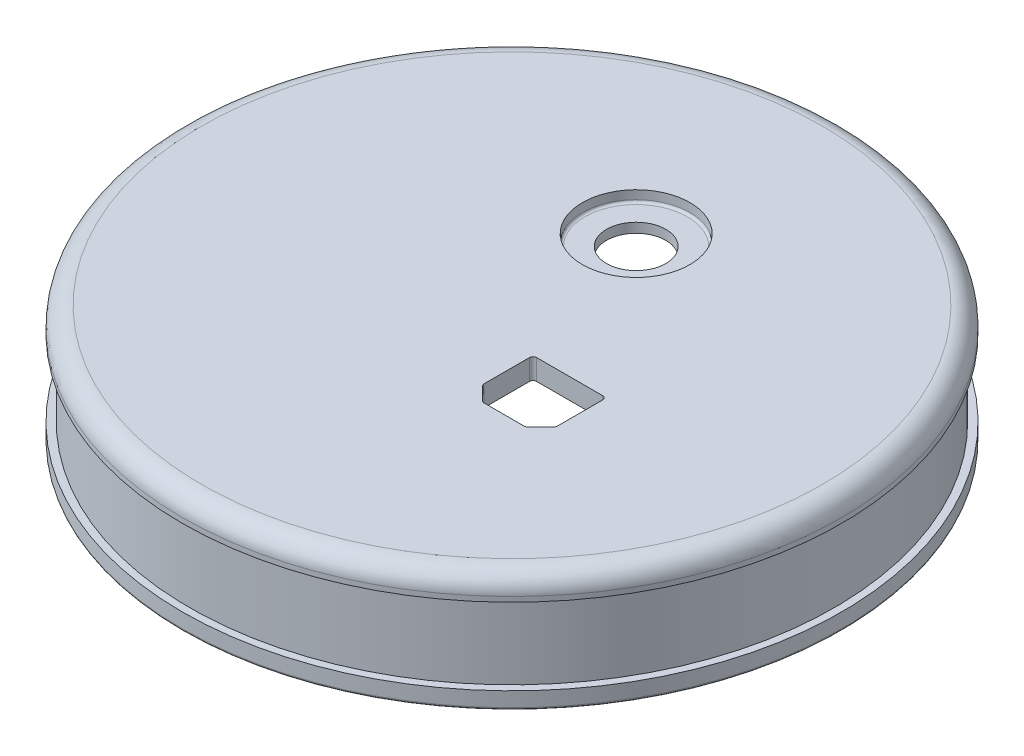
ISO-10303-21;
HEADER;
FILE_DESCRIPTION(('STEP AP214'),'2;1');
FILE_NAME('part.step','',(''),(''),'','','');
FILE_SCHEMA(('AUTOMOTIVE_DESIGN { 1 0 10303 214 1 1 1 1 }'));
ENDSEC;
DATA;
#1=APPLICATION_CONTEXT('core data for automotive mechanical design processes');
#2=APPLICATION_PROTOCOL_DEFINITION('international standard','automotive_design',2000,#1);
#3=PRODUCT_CONTEXT('',#1,'mechanical');
#4=PRODUCT('Part','Part','',(#3));
#5=PRODUCT_RELATED_PRODUCT_CATEGORY('part','',(#4));
#6=PRODUCT_DEFINITION_FORMATION('','',#4);
#7=PRODUCT_DEFINITION_CONTEXT('part definition',#1,'design');
#8=PRODUCT_DEFINITION('design','',#6,#7);
#9=PRODUCT_DEFINITION_SHAPE('','',#8);
#10=(LENGTH_UNIT() NAMED_UNIT(*) SI_UNIT(.MILLI.,.METRE.));
#11=(NAMED_UNIT(*) PLANE_ANGLE_UNIT() SI_UNIT($,.RADIAN.));
#12=(NAMED_UNIT(*) SI_UNIT($,.STERADIAN.) SOLID_ANGLE_UNIT());
#13=UNCERTAINTY_MEASURE_WITH_UNIT(LENGTH_MEASURE(1.E-05),#10,'distance_accuracy_value','');
#14=(GEOMETRIC_REPRESENTATION_CONTEXT(3) GLOBAL_UNCERTAINTY_ASSIGNED_CONTEXT((#13)) GLOBAL_UNIT_ASSIGNED_CONTEXT((#10,
#11,#12)) REPRESENTATION_CONTEXT('',''));
#15=CARTESIAN_POINT('',(0.,0.,0.));
#16=DIRECTION('',(0.,0.,1.));
#17=DIRECTION('',(1.,0.,0.));
#18=AXIS2_PLACEMENT_3D('',#15,#16,#17);
#19=CARTESIAN_POINT('',(0.,-16.1906587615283,0.));
#20=DIRECTION('',(0.,-1.,0.));
#21=DIRECTION('',(0.,0.,-1.));
#22=AXIS2_PLACEMENT_3D('',#19,#20,#21);
#23=CYLINDRICAL_SURFACE('',#22,31.61);
#24=CARTESIAN_POINT('',(0.,-3.97965488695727,0.));
#25=DIRECTION('',(0.,1.,0.));
#26=DIRECTION('',(0.,0.,1.));
#27=AXIS2_PLACEMENT_3D('',#24,#25,#26);
#28=CIRCLE('',#27,31.61);
#29=CARTESIAN_POINT('',(0.,-3.97965488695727,31.61));
#30=VERTEX_POINT('',#29);
#31=EDGE_CURVE('E337',#30,#30,#28,.T.);
#32=ORIENTED_EDGE('',*,*,#31,.F.);
#33=EDGE_LOOP('',(#32));
#34=FACE_BOUND('',#33,.T.);
#35=CARTESIAN_POINT('',(0.,-1.69999999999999,0.));
#36=DIRECTION('',(0.,1.,0.));
#37=DIRECTION('',(0.,0.,1.));
#38=AXIS2_PLACEMENT_3D('',#35,#36,#37);
#39=CIRCLE('',#38,31.61);
#40=CARTESIAN_POINT('',(0.,-1.69999999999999,31.61));
#41=VERTEX_POINT('',#40);
#42=EDGE_CURVE('E714',#41,#41,#39,.T.);
#43=ORIENTED_EDGE('',*,*,#42,.T.);
#44=EDGE_LOOP('',(#43));
#45=FACE_BOUND('',#44,.T.);
#46=ADVANCED_FACE('F30',(#34,#45),#23,.F.);
#47=CARTESIAN_POINT('',(0.,-9.63065488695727,0.));
#48=DIRECTION('',(0.,-1.,0.));
#49=DIRECTION('',(0.,0.,-1.));
#50=AXIS2_PLACEMENT_3D('',#47,#48,#49);
#51=CIRCLE('',#50,31.61);
#52=CARTESIAN_POINT('',(0.,-9.63065488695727,-31.61));
#53=VERTEX_POINT('',#52);
#54=EDGE_CURVE('E159',#53,#53,#51,.T.);
#55=ORIENTED_EDGE('',*,*,#54,.T.);
#56=EDGE_LOOP('',(#55));
#57=FACE_BOUND('',#56,.T.);
#58=CARTESIAN_POINT('',(0.,-4.74165488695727,0.));
#59=DIRECTION('',(0.,1.,0.));
#60=DIRECTION('',(0.,0.,1.));
#61=AXIS2_PLACEMENT_3D('',#58,#59,#60);
#62=CIRCLE('',#61,31.61);
#63=CARTESIAN_POINT('',(0.,-4.74165488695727,31.61));
#64=VERTEX_POINT('',#63);
#65=EDGE_CURVE('E340',#64,#64,#62,.T.);
#66=ORIENTED_EDGE('',*,*,#65,.T.);
#67=EDGE_LOOP('',(#66));
#68=FACE_BOUND('',#67,.T.);
#69=ADVANCED_FACE('F200',(#57,#68),#23,.F.);
#70=CARTESIAN_POINT('',(31.61,-10.1386548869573,0.));
#71=DIRECTION('',(0.,-1.,0.));
#72=DIRECTION('',(0.,0.,-1.));
#73=AXIS2_PLACEMENT_3D('',#70,#71,#72);
#74=PLANE('',#73);
#75=CARTESIAN_POINT('',(0.,-10.1386548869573,0.));
#76=DIRECTION('',(0.,-1.,0.));
#77=DIRECTION('',(0.,0.,-1.));
#78=AXIS2_PLACEMENT_3D('',#75,#76,#77);
#79=CIRCLE('',#78,34.118);
#80=CARTESIAN_POINT('',(0.,-10.1386548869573,-34.118));
#81=VERTEX_POINT('',#80);
#82=EDGE_CURVE('E171',#81,#81,#79,.T.);
#83=ORIENTED_EDGE('',*,*,#82,.T.);
#84=EDGE_LOOP('',(#83));
#85=FACE_BOUND('',#84,.T.);
#86=CARTESIAN_POINT('',(0.,-10.1386548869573,0.));
#87=DIRECTION('',(0.,-1.,0.));
#88=DIRECTION('',(0.,0.,-1.));
#89=AXIS2_PLACEMENT_3D('',#86,#87,#88);
#90=CIRCLE('',#89,32.118);
#91=CARTESIAN_POINT('',(0.,-10.1386548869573,-32.118));
#92=VERTEX_POINT('',#91);
#93=EDGE_CURVE('E162',#92,#92,#90,.F.);
#94=ORIENTED_EDGE('',*,*,#93,.T.);
#95=EDGE_LOOP('',(#94));
#96=FACE_BOUND('',#95,.T.);
#97=ADVANCED_FACE('F32',(#85,#96),#74,.T.);
#98=CARTESIAN_POINT('',(0.,-16.1906587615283,0.));
#99=DIRECTION('',(0.,-1.,0.));
#100=DIRECTION('',(0.,0.,-1.));
#101=AXIS2_PLACEMENT_3D('',#98,#99,#100);
#102=CYLINDRICAL_SURFACE('',#101,34.372);
#103=CARTESIAN_POINT('',(0.,-9.88465488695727,0.));
#104=DIRECTION('',(0.,-1.,0.));
#105=DIRECTION('',(0.,0.,-1.));
#106=AXIS2_PLACEMENT_3D('',#103,#104,#105);
#107=CIRCLE('',#106,34.372);
#108=CARTESIAN_POINT('',(0.,-9.88465488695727,-34.372));
#109=VERTEX_POINT('',#108);
#110=EDGE_CURVE('E174',#109,#109,#107,.F.);
#111=ORIENTED_EDGE('',*,*,#110,.T.);
#112=EDGE_LOOP('',(#111));
#113=FACE_BOUND('',#112,.T.);
#114=CARTESIAN_POINT('',(0.,-8.36065488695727,0.));
#115=DIRECTION('',(0.,-1.,0.));
#116=DIRECTION('',(0.,0.,-1.));
#117=AXIS2_PLACEMENT_3D('',#114,#115,#116);
#118=CIRCLE('',#117,34.372);
#119=CARTESIAN_POINT('',(0.,-8.36065488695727,-34.372));
#120=VERTEX_POINT('',#119);
#121=EDGE_CURVE('E251',#120,#120,#118,.T.);
#122=ORIENTED_EDGE('',*,*,#121,.T.);
#123=EDGE_LOOP('',(#122));
#124=FACE_BOUND('',#123,.T.);
#125=ADVANCED_FACE('F239',(#113,#124),#102,.T.);
#126=CARTESIAN_POINT('',(34.372,-8.36065488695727,0.));
#127=DIRECTION('',(0.,1.,0.));
#128=DIRECTION('',(0.,0.,1.));
#129=AXIS2_PLACEMENT_3D('',#126,#127,#128);
#130=PLANE('',#129);
#131=CARTESIAN_POINT('',(0.,-8.36065488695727,0.));
#132=DIRECTION('',(0.,-1.,0.));
#133=DIRECTION('',(0.,0.,-1.));
#134=AXIS2_PLACEMENT_3D('',#131,#132,#133);
#135=CIRCLE('',#134,33.61);
#136=CARTESIAN_POINT('',(0.,-8.36065488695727,-33.61));
#137=VERTEX_POINT('',#136);
#138=EDGE_CURVE('E254',#137,#137,#135,.T.);
#139=ORIENTED_EDGE('',*,*,#138,.T.);
#140=EDGE_LOOP('',(#139));
#141=FACE_BOUND('',#140,.T.);
#142=ORIENTED_EDGE('',*,*,#121,.F.);
#143=EDGE_LOOP('',(#142));
#144=FACE_BOUND('',#143,.T.);
#145=ADVANCED_FACE('F236',(#141,#144),#130,.T.);
#146=CARTESIAN_POINT('',(0.,-16.1906587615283,0.));
#147=DIRECTION('',(0.,-1.,0.));
#148=DIRECTION('',(0.,0.,-1.));
#149=AXIS2_PLACEMENT_3D('',#146,#147,#148);
#150=CYLINDRICAL_SURFACE('',#149,33.61);
#151=CARTESIAN_POINT('',(0.,-0.360654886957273,0.));
#152=DIRECTION('',(0.,-1.,0.));
#153=DIRECTION('',(0.,0.,-1.));
#154=AXIS2_PLACEMENT_3D('',#151,#152,#153);
#155=CIRCLE('',#154,33.61);
#156=CARTESIAN_POINT('',(0.,-0.360654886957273,-33.61));
#157=VERTEX_POINT('',#156);
#158=EDGE_CURVE('E260',#157,#157,#155,.T.);
#159=ORIENTED_EDGE('',*,*,#158,.T.);
#160=EDGE_LOOP('',(#159));
#161=FACE_BOUND('',#160,.T.);
#162=ORIENTED_EDGE('',*,*,#138,.F.);
#163=EDGE_LOOP('',(#162));
#164=FACE_BOUND('',#163,.T.);
#165=ADVANCED_FACE('F232',(#161,#164),#150,.T.);
#166=CARTESIAN_POINT('',(33.61,-0.360654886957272,0.));
#167=DIRECTION('',(0.,-1.,0.));
#168=DIRECTION('',(0.,0.,-1.));
#169=AXIS2_PLACEMENT_3D('',#166,#167,#168);
#170=PLANE('',#169);
#171=CARTESIAN_POINT('',(0.,-0.360654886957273,0.));
#172=DIRECTION('',(0.,-1.,0.));
#173=DIRECTION('',(0.,0.,-1.));
#174=AXIS2_PLACEMENT_3D('',#171,#172,#173);
#175=CIRCLE('',#174,34.372);
#176=CARTESIAN_POINT('',(0.,-0.360654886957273,-34.372));
#177=VERTEX_POINT('',#176);
#178=EDGE_CURVE('E355',#177,#177,#175,.T.);
#179=ORIENTED_EDGE('',*,*,#178,.T.);
#180=EDGE_LOOP('',(#179));
#181=FACE_BOUND('',#180,.T.);
#182=ORIENTED_EDGE('',*,*,#158,.F.);
#183=EDGE_LOOP('',(#182));
#184=FACE_BOUND('',#183,.T.);
#185=ADVANCED_FACE('F228',(#181,#184),#170,.T.);
#186=CARTESIAN_POINT('',(0.,-16.1906587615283,0.));
#187=DIRECTION('',(0.,-1.,0.));
#188=DIRECTION('',(0.,0.,-1.));
#189=AXIS2_PLACEMENT_3D('',#186,#187,#188);
#190=CYLINDRICAL_SURFACE('',#189,34.372);
#191=CARTESIAN_POINT('',(0.,0.158999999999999,0.));
#192=DIRECTION('',(0.,-1.,0.));
#193=DIRECTION('',(0.,0.,-1.));
#194=AXIS2_PLACEMENT_3D('',#191,#192,#193);
#195=CIRCLE('',#194,34.372);
#196=CARTESIAN_POINT('',(0.,0.158999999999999,-34.372));
#197=VERTEX_POINT('',#196);
#198=EDGE_CURVE('E352',#197,#197,#195,.T.);
#199=ORIENTED_EDGE('',*,*,#198,.T.);
#200=EDGE_LOOP('',(#199));
#201=FACE_BOUND('',#200,.T.);
#202=ORIENTED_EDGE('',*,*,#178,.F.);
#203=EDGE_LOOP('',(#202));
#204=FACE_BOUND('',#203,.T.);
#205=ADVANCED_FACE('F224',(#201,#204),#190,.T.);
#206=CARTESIAN_POINT('',(0.,0.158999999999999,0.));
#207=DIRECTION('',(0.,-1.,0.));
#208=DIRECTION('',(0.,0.,-1.));
#209=AXIS2_PLACEMENT_3D('',#206,#207,#208);
#210=TOROIDAL_SURFACE('',#209,32.372,2.);
#211=CARTESIAN_POINT('',(0.,2.159,0.));
#212=DIRECTION('',(0.,-1.,0.));
#213=DIRECTION('',(0.,0.,-1.));
#214=AXIS2_PLACEMENT_3D('',#211,#212,#213);
#215=CIRCLE('',#214,32.372);
#216=CARTESIAN_POINT('',(0.,2.159,-32.372));
#217=VERTEX_POINT('',#216);
#218=EDGE_CURVE('E349',#217,#217,#215,.T.);
#219=ORIENTED_EDGE('',*,*,#218,.T.);
#220=EDGE_LOOP('',(#219));
#221=FACE_BOUND('',#220,.T.);
#222=ORIENTED_EDGE('',*,*,#198,.F.);
#223=EDGE_LOOP('',(#222));
#224=FACE_BOUND('',#223,.T.);
#225=ADVANCED_FACE('F221',(#221,#224),#210,.T.);
#226=CARTESIAN_POINT('',(32.372,2.159,0.));
#227=DIRECTION('',(0.,1.,0.));
#228=DIRECTION('',(0.,0.,1.));
#229=AXIS2_PLACEMENT_3D('',#226,#227,#228);
#230=PLANE('',#229);
#231=DIRECTION('',(0.,0.,1.));
#232=VECTOR('',#231,1.);
#233=CARTESIAN_POINT('',(5.6352,2.159,3.4372));
#234=LINE('',#233,#232);
#235=CARTESIAN_POINT('',(5.6352,2.159,3.8182));
#236=VERTEX_POINT('',#235);
#237=CARTESIAN_POINT('',(5.6352,2.159,8.54201643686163));
#238=VERTEX_POINT('',#237);
#239=EDGE_CURVE('E713',#236,#238,#234,.T.);
#240=ORIENTED_EDGE('',*,*,#239,.F.);
#241=CARTESIAN_POINT('',(6.0162,2.159,3.8182));
#242=DIRECTION('',(0.,1.,0.));
#243=DIRECTION('',(0.,0.,1.));
#244=AXIS2_PLACEMENT_3D('',#241,#242,#243);
#245=CIRCLE('',#244,0.381);
#246=CARTESIAN_POINT('',(6.0162,2.159,3.4372));
#247=VERTEX_POINT('',#246);
#248=EDGE_CURVE('E45',#236,#247,#245,.F.);
#249=ORIENTED_EDGE('',*,*,#248,.T.);
#250=DIRECTION('',(-1.,0.,0.));
#251=VECTOR('',#250,1.);
#252=CARTESIAN_POINT('',(5.6352,2.159,3.4372));
#253=LINE('',#252,#251);
#254=CARTESIAN_POINT('',(12.8978,2.159,3.4372));
#255=VERTEX_POINT('',#254);
#256=EDGE_CURVE('E322',#255,#247,#253,.T.);
#257=ORIENTED_EDGE('',*,*,#256,.F.);
#258=CARTESIAN_POINT('',(12.8978,2.159,3.8182));
#259=DIRECTION('',(0.,1.,0.));
#260=DIRECTION('',(0.,0.,1.));
#261=AXIS2_PLACEMENT_3D('',#258,#259,#260);
#262=CIRCLE('',#261,0.381);
#263=CARTESIAN_POINT('',(13.2788,2.159,3.8182));
#264=VERTEX_POINT('',#263);
#265=EDGE_CURVE('E53',#255,#264,#262,.F.);
#266=ORIENTED_EDGE('',*,*,#265,.T.);
#267=DIRECTION('',(0.,0.,-1.));
#268=VECTOR('',#267,1.);
#269=CARTESIAN_POINT('',(13.2788,2.159,3.4372));
#270=LINE('',#269,#268);
#271=CARTESIAN_POINT('',(13.2788,2.159,8.54201643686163));
#272=VERTEX_POINT('',#271);
#273=EDGE_CURVE('E128',#272,#264,#270,.T.);
#274=ORIENTED_EDGE('',*,*,#273,.F.);
#275=CARTESIAN_POINT('',(12.8978,2.159,8.54201643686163));
#276=DIRECTION('',(0.,1.,0.));
#277=DIRECTION('',(0.,0.,1.));
#278=AXIS2_PLACEMENT_3D('',#275,#276,#277);
#279=CIRCLE('',#278,0.381);
#280=CARTESIAN_POINT('',(13.1672076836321,2.159,8.81142412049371));
#281=VERTEX_POINT('',#280);
#282=EDGE_CURVE('E295',#272,#281,#279,.F.);
#283=ORIENTED_EDGE('',*,*,#282,.T.);
#284=DIRECTION('',(0.707106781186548,0.,-0.707106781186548));
#285=VECTOR('',#284,1.);
#286=CARTESIAN_POINT('',(11.6978318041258,2.159,10.2808));
#287=LINE('',#286,#285);
#288=CARTESIAN_POINT('',(11.8094241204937,2.159,10.1692076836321));
#289=VERTEX_POINT('',#288);
#290=EDGE_CURVE('E328',#289,#281,#287,.T.);
#291=ORIENTED_EDGE('',*,*,#290,.F.);
#292=CARTESIAN_POINT('',(11.5400164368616,2.159,9.8998));
#293=DIRECTION('',(0.,1.,0.));
#294=DIRECTION('',(0.,0.,1.));
#295=AXIS2_PLACEMENT_3D('',#292,#293,#294);
#296=CIRCLE('',#295,0.381);
#297=CARTESIAN_POINT('',(11.5400164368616,2.159,10.2808));
#298=VERTEX_POINT('',#297);
#299=EDGE_CURVE('E298',#289,#298,#296,.F.);
#300=ORIENTED_EDGE('',*,*,#299,.T.);
#301=DIRECTION('',(1.,0.,0.));
#302=VECTOR('',#301,1.);
#303=CARTESIAN_POINT('',(7.21616819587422,2.159,10.2808));
#304=LINE('',#303,#302);
#305=CARTESIAN_POINT('',(7.37398356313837,2.159,10.2808));
#306=VERTEX_POINT('',#305);
#307=EDGE_CURVE('E723',#306,#298,#304,.T.);
#308=ORIENTED_EDGE('',*,*,#307,.F.);
#309=CARTESIAN_POINT('',(7.37398356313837,2.159,9.8998));
#310=DIRECTION('',(0.,1.,0.));
#311=DIRECTION('',(0.,0.,1.));
#312=AXIS2_PLACEMENT_3D('',#309,#310,#311);
#313=CIRCLE('',#312,0.381);
#314=CARTESIAN_POINT('',(7.10457587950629,2.159,10.1692076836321));
#315=VERTEX_POINT('',#314);
#316=EDGE_CURVE('E302',#306,#315,#313,.F.);
#317=ORIENTED_EDGE('',*,*,#316,.T.);
#318=DIRECTION('',(0.707106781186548,0.,0.707106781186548));
#319=VECTOR('',#318,1.);
#320=CARTESIAN_POINT('',(7.21616819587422,2.159,10.2808));
#321=LINE('',#320,#319);
#322=CARTESIAN_POINT('',(5.74679231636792,2.159,8.8114241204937));
#323=VERTEX_POINT('',#322);
#324=EDGE_CURVE('E716',#323,#315,#321,.T.);
#325=ORIENTED_EDGE('',*,*,#324,.F.);
#326=CARTESIAN_POINT('',(6.0162,2.159,8.54201643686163));
#327=DIRECTION('',(0.,1.,0.));
#328=DIRECTION('',(0.,0.,1.));
#329=AXIS2_PLACEMENT_3D('',#326,#327,#328);
#330=CIRCLE('',#329,0.381);
#331=EDGE_CURVE('E306',#323,#238,#330,.F.);
#332=ORIENTED_EDGE('',*,*,#331,.T.);
#333=EDGE_LOOP('',(#240,#249,#257,#266,#274,#283,#291,#300,#308,#317,#325,#332));
#334=FACE_BOUND('',#333,.T.);
#335=CARTESIAN_POINT('',(0.,2.159,-12.9492));
#336=DIRECTION('',(0.,1.,0.));
#337=DIRECTION('',(0.,0.,1.));
#338=AXIS2_PLACEMENT_3D('',#335,#336,#337);
#339=CIRCLE('',#338,5.608);
#340=CARTESIAN_POINT('',(0.,2.159,-7.3412));
#341=VERTEX_POINT('',#340);
#342=EDGE_CURVE('E334',#341,#341,#339,.T.);
#343=ORIENTED_EDGE('',*,*,#342,.F.);
#344=EDGE_LOOP('',(#343));
#345=FACE_BOUND('',#344,.T.);
#346=ORIENTED_EDGE('',*,*,#218,.F.);
#347=EDGE_LOOP('',(#346));
#348=FACE_BOUND('',#347,.T.);
#349=ADVANCED_FACE('F217',(#334,#345,#348),#230,.T.);
#350=CARTESIAN_POINT('',(0.,-4.36065488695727,0.));
#351=DIRECTION('',(0.,1.,0.));
#352=DIRECTION('',(0.,0.,1.));
#353=AXIS2_PLACEMENT_3D('',#350,#351,#352);
#354=TOROIDAL_SURFACE('',#353,31.61,0.381000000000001);
#355=ORIENTED_EDGE('',*,*,#65,.F.);
#356=EDGE_LOOP('',(#355));
#357=FACE_BOUND('',#356,.T.);
#358=ORIENTED_EDGE('',*,*,#31,.T.);
#359=EDGE_LOOP('',(#358));
#360=FACE_BOUND('',#359,.T.);
#361=ADVANCED_FACE('F220',(#357,#360),#354,.T.);
#362=CARTESIAN_POINT('',(0.,0.762,-24.15));
#363=DIRECTION('',(0.,-1.,0.));
#364=DIRECTION('',(0.,0.,1.));
#365=AXIS2_PLACEMENT_3D('',#362,#363,#364);
#366=PLANE('',#365);
#367=CARTESIAN_POINT('',(0.,0.762,-24.15));
#368=DIRECTION('',(0.,-1.,0.));
#369=DIRECTION('',(0.,0.,-1.));
#370=AXIS2_PLACEMENT_3D('',#367,#368,#369);
#371=CIRCLE('',#370,2.6035);
#372=CARTESIAN_POINT('',(0.,0.762,-26.7535));
#373=VERTEX_POINT('',#372);
#374=EDGE_CURVE('E180',#373,#373,#371,.T.);
#375=ORIENTED_EDGE('',*,*,#374,.T.);
#376=EDGE_LOOP('',(#375));
#377=FACE_BOUND('',#376,.T.);
#378=ADVANCED_FACE('F383',(#377),#366,.T.);
#379=CARTESIAN_POINT('',(0.,0.762,24.15));
#380=DIRECTION('',(0.,-1.,0.));
#381=DIRECTION('',(0.,0.,-1.));
#382=AXIS2_PLACEMENT_3D('',#379,#380,#381);
#383=PLANE('',#382);
#384=CARTESIAN_POINT('',(0.,0.762,24.15));
#385=DIRECTION('',(0.,-1.,0.));
#386=DIRECTION('',(0.,0.,-1.));
#387=AXIS2_PLACEMENT_3D('',#384,#385,#386);
#388=CIRCLE('',#387,2.6035);
#389=CARTESIAN_POINT('',(0.,0.762,21.5465));
#390=VERTEX_POINT('',#389);
#391=EDGE_CURVE('E38',#390,#390,#388,.T.);
#392=ORIENTED_EDGE('',*,*,#391,.T.);
#393=EDGE_LOOP('',(#392));
#394=FACE_BOUND('',#393,.T.);
#395=ADVANCED_FACE('F185',(#394),#383,.T.);
#396=CARTESIAN_POINT('',(0.,0.762,-24.15));
#397=DIRECTION('',(0.,-1.,0.));
#398=DIRECTION('',(0.,0.,-1.));
#399=AXIS2_PLACEMENT_3D('',#396,#397,#398);
#400=CYLINDRICAL_SURFACE('',#399,3.1115);
#401=CARTESIAN_POINT('',(0.,0.254,-24.15));
#402=DIRECTION('',(0.,-1.,0.));
#403=DIRECTION('',(0.,0.,-1.));
#404=AXIS2_PLACEMENT_3D('',#401,#402,#403);
#405=CIRCLE('',#404,3.1115);
#406=CARTESIAN_POINT('',(0.,0.254,-27.2615));
#407=VERTEX_POINT('',#406);
#408=EDGE_CURVE('E177',#407,#407,#405,.F.);
#409=ORIENTED_EDGE('',*,*,#408,.T.);
#410=EDGE_LOOP('',(#409));
#411=FACE_BOUND('',#410,.T.);
#412=CARTESIAN_POINT('',(0.,0.,-24.15));
#413=DIRECTION('',(0.,1.,0.));
#414=DIRECTION('',(0.,0.,1.));
#415=AXIS2_PLACEMENT_3D('',#412,#413,#414);
#416=CIRCLE('',#415,3.1115);
#417=CARTESIAN_POINT('',(0.,0.,-21.0385));
#418=VERTEX_POINT('',#417);
#419=EDGE_CURVE('E343',#418,#418,#416,.T.);
#420=ORIENTED_EDGE('',*,*,#419,.F.);
#421=EDGE_LOOP('',(#420));
#422=FACE_BOUND('',#421,.T.);
#423=ADVANCED_FACE('F374',(#411,#422),#400,.F.);
#424=CARTESIAN_POINT('',(0.,0.762,24.15));
#425=DIRECTION('',(0.,-1.,0.));
#426=DIRECTION('',(0.,0.,-1.));
#427=AXIS2_PLACEMENT_3D('',#424,#425,#426);
#428=CYLINDRICAL_SURFACE('',#427,3.1115);
#429=CARTESIAN_POINT('',(0.,0.254,24.15));
#430=DIRECTION('',(0.,-1.,0.));
#431=DIRECTION('',(0.,0.,-1.));
#432=AXIS2_PLACEMENT_3D('',#429,#430,#431);
#433=CIRCLE('',#432,3.1115);
#434=CARTESIAN_POINT('',(0.,0.254,21.0385));
#435=VERTEX_POINT('',#434);
#436=EDGE_CURVE('E11',#435,#435,#433,.F.);
#437=ORIENTED_EDGE('',*,*,#436,.T.);
#438=EDGE_LOOP('',(#437));
#439=FACE_BOUND('',#438,.T.);
#440=CARTESIAN_POINT('',(0.,0.,24.15));
#441=DIRECTION('',(0.,-1.,0.));
#442=DIRECTION('',(0.,0.,-1.));
#443=AXIS2_PLACEMENT_3D('',#440,#441,#442);
#444=CIRCLE('',#443,3.1115);
#445=CARTESIAN_POINT('',(0.,0.,21.0385));
#446=VERTEX_POINT('',#445);
#447=EDGE_CURVE('E346',#446,#446,#444,.T.);
#448=ORIENTED_EDGE('',*,*,#447,.T.);
#449=EDGE_LOOP('',(#448));
#450=FACE_BOUND('',#449,.T.);
#451=ADVANCED_FACE('F211',(#439,#450),#428,.F.);
#452=CARTESIAN_POINT('',(31.61,0.,0.));
#453=DIRECTION('',(0.,-1.,0.));
#454=DIRECTION('',(0.,0.,-1.));
#455=AXIS2_PLACEMENT_3D('',#452,#453,#454);
#456=PLANE('',#455);
#457=CARTESIAN_POINT('',(0.,0.,0.));
#458=DIRECTION('',(0.,-1.,0.));
#459=DIRECTION('',(0.,0.,-1.));
#460=AXIS2_PLACEMENT_3D('',#457,#458,#459);
#461=CIRCLE('',#460,27.813);
#462=CARTESIAN_POINT('',(0.,0.,-27.813));
#463=VERTEX_POINT('',#462);
#464=EDGE_CURVE('E151',#463,#463,#461,.T.);
#465=ORIENTED_EDGE('',*,*,#464,.T.);
#466=EDGE_LOOP('',(#465));
#467=FACE_BOUND('',#466,.T.);
#468=DIRECTION('',(0.,0.,-1.));
#469=VECTOR('',#468,1.);
#470=CARTESIAN_POINT('',(5.6352,0.,0.));
#471=LINE('',#470,#469);
#472=CARTESIAN_POINT('',(5.6352,0.,8.54201643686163));
#473=VERTEX_POINT('',#472);
#474=CARTESIAN_POINT('',(5.6352,0.,3.8182));
#475=VERTEX_POINT('',#474);
#476=EDGE_CURVE('E131',#473,#475,#471,.T.);
#477=ORIENTED_EDGE('',*,*,#476,.F.);
#478=CARTESIAN_POINT('',(6.0162,0.,8.54201643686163));
#479=DIRECTION('',(0.,-1.,0.));
#480=DIRECTION('',(0.,0.,-1.));
#481=AXIS2_PLACEMENT_3D('',#478,#479,#480);
#482=CIRCLE('',#481,0.381);
#483=CARTESIAN_POINT('',(5.74679231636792,0.,8.8114241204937));
#484=VERTEX_POINT('',#483);
#485=EDGE_CURVE('E308',#473,#484,#482,.F.);
#486=ORIENTED_EDGE('',*,*,#485,.T.);
#487=DIRECTION('',(-0.707106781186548,0.,-0.707106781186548));
#488=VECTOR('',#487,1.);
#489=CARTESIAN_POINT('',(14.2726840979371,0.,17.3373159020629));
#490=LINE('',#489,#488);
#491=CARTESIAN_POINT('',(7.10457587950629,0.,10.1692076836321));
#492=VERTEX_POINT('',#491);
#493=EDGE_CURVE('E253',#492,#484,#490,.T.);
#494=ORIENTED_EDGE('',*,*,#493,.F.);
#495=CARTESIAN_POINT('',(7.37398356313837,0.,9.8998));
#496=DIRECTION('',(0.,-1.,0.));
#497=DIRECTION('',(0.,0.,-1.));
#498=AXIS2_PLACEMENT_3D('',#495,#496,#497);
#499=CIRCLE('',#498,0.381);
#500=CARTESIAN_POINT('',(7.37398356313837,0.,10.2808));
#501=VERTEX_POINT('',#500);
#502=EDGE_CURVE('E304',#492,#501,#499,.F.);
#503=ORIENTED_EDGE('',*,*,#502,.T.);
#504=DIRECTION('',(-1.,0.,0.));
#505=VECTOR('',#504,1.);
#506=CARTESIAN_POINT('',(31.61,0.,10.2808));
#507=LINE('',#506,#505);
#508=CARTESIAN_POINT('',(11.5400164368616,0.,10.2808));
#509=VERTEX_POINT('',#508);
#510=EDGE_CURVE('E257',#509,#501,#507,.T.);
#511=ORIENTED_EDGE('',*,*,#510,.F.);
#512=CARTESIAN_POINT('',(11.5400164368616,0.,9.8998));
#513=DIRECTION('',(0.,-1.,0.));
#514=DIRECTION('',(0.,0.,-1.));
#515=AXIS2_PLACEMENT_3D('',#512,#513,#514);
#516=CIRCLE('',#515,0.381);
#517=CARTESIAN_POINT('',(11.8094241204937,0.,10.1692076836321));
#518=VERTEX_POINT('',#517);
#519=EDGE_CURVE('E300',#509,#518,#516,.F.);
#520=ORIENTED_EDGE('',*,*,#519,.T.);
#521=DIRECTION('',(-0.707106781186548,0.,0.707106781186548));
#522=VECTOR('',#521,1.);
#523=CARTESIAN_POINT('',(26.7943159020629,0.,-4.81568409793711));
#524=LINE('',#523,#522);
#525=CARTESIAN_POINT('',(13.1672076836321,0.,8.81142412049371));
#526=VERTEX_POINT('',#525);
#527=EDGE_CURVE('E144',#526,#518,#524,.T.);
#528=ORIENTED_EDGE('',*,*,#527,.F.);
#529=CARTESIAN_POINT('',(12.8978,0.,8.54201643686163));
#530=DIRECTION('',(0.,-1.,0.));
#531=DIRECTION('',(0.,0.,-1.));
#532=AXIS2_PLACEMENT_3D('',#529,#530,#531);
#533=CIRCLE('',#532,0.381);
#534=CARTESIAN_POINT('',(13.2788,0.,8.54201643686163));
#535=VERTEX_POINT('',#534);
#536=EDGE_CURVE('E142',#526,#535,#533,.F.);
#537=ORIENTED_EDGE('',*,*,#536,.T.);
#538=DIRECTION('',(0.,0.,1.));
#539=VECTOR('',#538,1.);
#540=CARTESIAN_POINT('',(13.2788,0.,0.));
#541=LINE('',#540,#539);
#542=CARTESIAN_POINT('',(13.2788,0.,3.8182));
#543=VERTEX_POINT('',#542);
#544=EDGE_CURVE('E125',#543,#535,#541,.T.);
#545=ORIENTED_EDGE('',*,*,#544,.F.);
#546=CARTESIAN_POINT('',(12.8978,0.,3.8182));
#547=DIRECTION('',(0.,-1.,0.));
#548=DIRECTION('',(0.,0.,-1.));
#549=AXIS2_PLACEMENT_3D('',#546,#547,#548);
#550=CIRCLE('',#549,0.381);
#551=CARTESIAN_POINT('',(12.8978,0.,3.4372));
#552=VERTEX_POINT('',#551);
#553=EDGE_CURVE('E138',#543,#552,#550,.F.);
#554=ORIENTED_EDGE('',*,*,#553,.T.);
#555=DIRECTION('',(1.,0.,0.));
#556=VECTOR('',#555,1.);
#557=CARTESIAN_POINT('',(31.61,0.,3.43719999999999));
#558=LINE('',#557,#556);
#559=CARTESIAN_POINT('',(6.0162,0.,3.4372));
#560=VERTEX_POINT('',#559);
#561=EDGE_CURVE('E143',#560,#552,#558,.T.);
#562=ORIENTED_EDGE('',*,*,#561,.F.);
#563=CARTESIAN_POINT('',(6.0162,0.,3.8182));
#564=DIRECTION('',(0.,-1.,0.));
#565=DIRECTION('',(0.,0.,-1.));
#566=AXIS2_PLACEMENT_3D('',#563,#564,#565);
#567=CIRCLE('',#566,0.381);
#568=EDGE_CURVE('E153',#560,#475,#567,.F.);
#569=ORIENTED_EDGE('',*,*,#568,.T.);
#570=EDGE_LOOP('',(#477,#486,#494,#503,#511,#520,#528,#537,#545,#554,#562,#569));
#571=FACE_BOUND('',#570,.T.);
#572=CARTESIAN_POINT('',(0.,0.,-12.9492));
#573=DIRECTION('',(0.,-1.,0.));
#574=DIRECTION('',(0.,0.,-1.));
#575=AXIS2_PLACEMENT_3D('',#572,#573,#574);
#576=CIRCLE('',#575,3.0922);
#577=CARTESIAN_POINT('',(0.,0.,-16.0414));
#578=VERTEX_POINT('',#577);
#579=EDGE_CURVE('E326',#578,#578,#576,.T.);
#580=ORIENTED_EDGE('',*,*,#579,.F.);
#581=EDGE_LOOP('',(#580));
#582=FACE_BOUND('',#581,.T.);
#583=ORIENTED_EDGE('',*,*,#447,.F.);
#584=EDGE_LOOP('',(#583));
#585=FACE_BOUND('',#584,.T.);
#586=ORIENTED_EDGE('',*,*,#419,.T.);
#587=EDGE_LOOP('',(#586));
#588=FACE_BOUND('',#587,.T.);
#589=ADVANCED_FACE('F135',(#467,#571,#582,#585,#588),#456,.T.);
#590=CARTESIAN_POINT('',(0.,-14.8618193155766,-12.9492));
#591=DIRECTION('',(0.,1.,0.));
#592=DIRECTION('',(0.,0.,1.));
#593=AXIS2_PLACEMENT_3D('',#590,#591,#592);
#594=CYLINDRICAL_SURFACE('',#593,5.608);
#595=CARTESIAN_POINT('',(0.,1.25400000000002,-12.9492));
#596=DIRECTION('',(0.,1.,0.));
#597=DIRECTION('',(0.,0.,1.));
#598=AXIS2_PLACEMENT_3D('',#595,#596,#597);
#599=CIRCLE('',#598,5.608);
#600=CARTESIAN_POINT('',(0.,1.25400000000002,-7.3412));
#601=VERTEX_POINT('',#600);
#602=EDGE_CURVE('E165',#601,#601,#599,.F.);
#603=ORIENTED_EDGE('',*,*,#602,.T.);
#604=EDGE_LOOP('',(#603));
#605=FACE_BOUND('',#604,.T.);
#606=ORIENTED_EDGE('',*,*,#342,.T.);
#607=EDGE_LOOP('',(#606));
#608=FACE_BOUND('',#607,.T.);
#609=ADVANCED_FACE('F215',(#605,#608),#594,.F.);
#610=CARTESIAN_POINT('',(0.,1.00000000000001,-12.9492));
#611=DIRECTION('',(0.,1.,0.));
#612=DIRECTION('',(1.,0.,0.));
#613=AXIS2_PLACEMENT_3D('',#610,#611,#612);
#614=PLANE('',#613);
#615=CARTESIAN_POINT('',(0.,1.00000000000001,-12.9492));
#616=DIRECTION('',(0.,1.,0.));
#617=DIRECTION('',(0.,0.,1.));
#618=AXIS2_PLACEMENT_3D('',#615,#616,#617);
#619=CIRCLE('',#618,5.354);
#620=CARTESIAN_POINT('',(0.,1.00000000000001,-7.5952));
#621=VERTEX_POINT('',#620);
#622=EDGE_CURVE('E168',#621,#621,#619,.T.);
#623=ORIENTED_EDGE('',*,*,#622,.T.);
#624=EDGE_LOOP('',(#623));
#625=FACE_BOUND('',#624,.T.);
#626=CARTESIAN_POINT('',(0.,1.00000000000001,-12.9492));
#627=DIRECTION('',(0.,1.,0.));
#628=DIRECTION('',(0.,0.,1.));
#629=AXIS2_PLACEMENT_3D('',#626,#627,#628);
#630=CIRCLE('',#629,3.0922);
#631=CARTESIAN_POINT('',(0.,1.00000000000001,-9.857));
#632=VERTEX_POINT('',#631);
#633=EDGE_CURVE('E323',#632,#632,#630,.T.);
#634=ORIENTED_EDGE('',*,*,#633,.F.);
#635=EDGE_LOOP('',(#634));
#636=FACE_BOUND('',#635,.T.);
#637=ADVANCED_FACE('F393',(#625,#636),#614,.T.);
#638=CARTESIAN_POINT('',(0.,-10.1386548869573,-12.9492));
#639=DIRECTION('',(0.,1.,0.));
#640=DIRECTION('',(0.,0.,1.));
#641=AXIS2_PLACEMENT_3D('',#638,#639,#640);
#642=CYLINDRICAL_SURFACE('',#641,3.0922);
#643=ORIENTED_EDGE('',*,*,#579,.T.);
#644=EDGE_LOOP('',(#643));
#645=FACE_BOUND('',#644,.T.);
#646=ORIENTED_EDGE('',*,*,#633,.T.);
#647=EDGE_LOOP('',(#646));
#648=FACE_BOUND('',#647,.T.);
#649=ADVANCED_FACE('F397',(#645,#648),#642,.F.);
#650=CARTESIAN_POINT('',(5.6352,-10.1386548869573,3.4372));
#651=DIRECTION('',(-1.,0.,0.));
#652=DIRECTION('',(0.,0.,1.));
#653=AXIS2_PLACEMENT_3D('',#650,#651,#652);
#654=PLANE('',#653);
#655=ORIENTED_EDGE('',*,*,#239,.T.);
#656=DIRECTION('',(0.,1.,0.));
#657=VECTOR('',#656,1.);
#658=CARTESIAN_POINT('',(5.6352,0.,8.54201643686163));
#659=LINE('',#658,#657);
#660=EDGE_CURVE('E290',#238,#473,#659,.F.);
#661=ORIENTED_EDGE('',*,*,#660,.T.);
#662=ORIENTED_EDGE('',*,*,#476,.T.);
#663=DIRECTION('',(0.,1.,0.));
#664=VECTOR('',#663,1.);
#665=CARTESIAN_POINT('',(5.6352,2.159,3.8182));
#666=LINE('',#665,#664);
#667=EDGE_CURVE('E287',#475,#236,#666,.T.);
#668=ORIENTED_EDGE('',*,*,#667,.T.);
#669=EDGE_LOOP('',(#655,#661,#662,#668));
#670=FACE_BOUND('',#669,.T.);
#671=ADVANCED_FACE('F317',(#670),#654,.F.);
#672=CARTESIAN_POINT('',(5.6352,-10.1386548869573,3.4372));
#673=DIRECTION('',(0.,0.,-1.));
#674=DIRECTION('',(-1.,0.,0.));
#675=AXIS2_PLACEMENT_3D('',#672,#673,#674);
#676=PLANE('',#675);
#677=ORIENTED_EDGE('',*,*,#256,.T.);
#678=DIRECTION('',(0.,1.,0.));
#679=VECTOR('',#678,1.);
#680=CARTESIAN_POINT('',(6.0162,0.,3.4372));
#681=LINE('',#680,#679);
#682=EDGE_CURVE('E293',#247,#560,#681,.F.);
#683=ORIENTED_EDGE('',*,*,#682,.T.);
#684=ORIENTED_EDGE('',*,*,#561,.T.);
#685=DIRECTION('',(0.,1.,0.));
#686=VECTOR('',#685,1.);
#687=CARTESIAN_POINT('',(12.8978,2.159,3.4372));
#688=LINE('',#687,#686);
#689=EDGE_CURVE('E147',#552,#255,#688,.T.);
#690=ORIENTED_EDGE('',*,*,#689,.T.);
#691=EDGE_LOOP('',(#677,#683,#684,#690));
#692=FACE_BOUND('',#691,.T.);
#693=ADVANCED_FACE('F321',(#692),#676,.F.);
#694=CARTESIAN_POINT('',(13.2788,-10.1386548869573,3.4372));
#695=DIRECTION('',(1.,0.,0.));
#696=DIRECTION('',(0.,0.,-1.));
#697=AXIS2_PLACEMENT_3D('',#694,#695,#696);
#698=PLANE('',#697);
#699=ORIENTED_EDGE('',*,*,#544,.T.);
#700=DIRECTION('',(0.,1.,0.));
#701=VECTOR('',#700,1.);
#702=CARTESIAN_POINT('',(13.2788,2.159,8.54201643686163));
#703=LINE('',#702,#701);
#704=EDGE_CURVE('E130',#535,#272,#703,.T.);
#705=ORIENTED_EDGE('',*,*,#704,.T.);
#706=ORIENTED_EDGE('',*,*,#273,.T.);
#707=DIRECTION('',(0.,1.,0.));
#708=VECTOR('',#707,1.);
#709=CARTESIAN_POINT('',(13.2788,0.,3.8182));
#710=LINE('',#709,#708);
#711=EDGE_CURVE('E121',#264,#543,#710,.F.);
#712=ORIENTED_EDGE('',*,*,#711,.T.);
#713=EDGE_LOOP('',(#699,#705,#706,#712));
#714=FACE_BOUND('',#713,.T.);
#715=ADVANCED_FACE('F123',(#714),#698,.F.);
#716=CARTESIAN_POINT('',(11.6978318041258,-10.1386548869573,10.2808));
#717=DIRECTION('',(0.707106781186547,0.,0.707106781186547));
#718=DIRECTION('',(0.707106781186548,0.,-0.707106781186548));
#719=AXIS2_PLACEMENT_3D('',#716,#717,#718);
#720=PLANE('',#719);
#721=ORIENTED_EDGE('',*,*,#290,.T.);
#722=DIRECTION('',(0.,1.,0.));
#723=VECTOR('',#722,1.);
#724=CARTESIAN_POINT('',(13.1672076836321,0.,8.81142412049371));
#725=LINE('',#724,#723);
#726=EDGE_CURVE('E275',#281,#526,#725,.F.);
#727=ORIENTED_EDGE('',*,*,#726,.T.);
#728=ORIENTED_EDGE('',*,*,#527,.T.);
#729=DIRECTION('',(0.,1.,0.));
#730=VECTOR('',#729,1.);
#731=CARTESIAN_POINT('',(11.8094241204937,2.159,10.1692076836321));
#732=LINE('',#731,#730);
#733=EDGE_CURVE('E272',#518,#289,#732,.T.);
#734=ORIENTED_EDGE('',*,*,#733,.T.);
#735=EDGE_LOOP('',(#721,#727,#728,#734));
#736=FACE_BOUND('',#735,.T.);
#737=ADVANCED_FACE('F412',(#736),#720,.F.);
#738=CARTESIAN_POINT('',(7.21616819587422,-10.1386548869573,10.2808));
#739=DIRECTION('',(0.,0.,1.));
#740=DIRECTION('',(1.,0.,0.));
#741=AXIS2_PLACEMENT_3D('',#738,#739,#740);
#742=PLANE('',#741);
#743=ORIENTED_EDGE('',*,*,#307,.T.);
#744=DIRECTION('',(0.,1.,0.));
#745=VECTOR('',#744,1.);
#746=CARTESIAN_POINT('',(11.5400164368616,0.,10.2808));
#747=LINE('',#746,#745);
#748=EDGE_CURVE('E280',#298,#509,#747,.F.);
#749=ORIENTED_EDGE('',*,*,#748,.T.);
#750=ORIENTED_EDGE('',*,*,#510,.T.);
#751=DIRECTION('',(0.,1.,0.));
#752=VECTOR('',#751,1.);
#753=CARTESIAN_POINT('',(7.37398356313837,2.159,10.2808));
#754=LINE('',#753,#752);
#755=EDGE_CURVE('E277',#501,#306,#754,.T.);
#756=ORIENTED_EDGE('',*,*,#755,.T.);
#757=EDGE_LOOP('',(#743,#749,#750,#756));
#758=FACE_BOUND('',#757,.T.);
#759=ADVANCED_FACE('F408',(#758),#742,.F.);
#760=CARTESIAN_POINT('',(7.21616819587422,-10.1386548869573,10.2808));
#761=DIRECTION('',(-0.707106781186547,0.,0.707106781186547));
#762=DIRECTION('',(0.707106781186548,0.,0.707106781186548));
#763=AXIS2_PLACEMENT_3D('',#760,#761,#762);
#764=PLANE('',#763);
#765=ORIENTED_EDGE('',*,*,#324,.T.);
#766=DIRECTION('',(0.,1.,0.));
#767=VECTOR('',#766,1.);
#768=CARTESIAN_POINT('',(7.10457587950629,0.,10.1692076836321));
#769=LINE('',#768,#767);
#770=EDGE_CURVE('E285',#315,#492,#769,.F.);
#771=ORIENTED_EDGE('',*,*,#770,.T.);
#772=ORIENTED_EDGE('',*,*,#493,.T.);
#773=DIRECTION('',(0.,1.,0.));
#774=VECTOR('',#773,1.);
#775=CARTESIAN_POINT('',(5.74679231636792,2.159,8.8114241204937));
#776=LINE('',#775,#774);
#777=EDGE_CURVE('E282',#484,#323,#776,.T.);
#778=ORIENTED_EDGE('',*,*,#777,.T.);
#779=EDGE_LOOP('',(#765,#771,#772,#778));
#780=FACE_BOUND('',#779,.T.);
#781=ADVANCED_FACE('F404',(#780),#764,.F.);
#782=CARTESIAN_POINT('',(0.,-91.1065814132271,0.));
#783=DIRECTION('',(0.,1.,0.));
#784=DIRECTION('',(0.,0.,1.));
#785=AXIS2_PLACEMENT_3D('',#782,#783,#784);
#786=CYLINDRICAL_SURFACE('',#785,28.321);
#787=CARTESIAN_POINT('',(0.,-0.507999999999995,0.));
#788=DIRECTION('',(0.,-1.,0.));
#789=DIRECTION('',(0.,0.,-1.));
#790=AXIS2_PLACEMENT_3D('',#787,#788,#789);
#791=CIRCLE('',#790,28.321);
#792=CARTESIAN_POINT('',(0.,-0.507999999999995,-28.321));
#793=VERTEX_POINT('',#792);
#794=EDGE_CURVE('E148',#793,#793,#791,.F.);
#795=ORIENTED_EDGE('',*,*,#794,.T.);
#796=EDGE_LOOP('',(#795));
#797=FACE_BOUND('',#796,.T.);
#798=CARTESIAN_POINT('',(0.,-1.69999999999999,0.));
#799=DIRECTION('',(0.,1.,0.));
#800=DIRECTION('',(0.,0.,1.));
#801=AXIS2_PLACEMENT_3D('',#798,#799,#800);
#802=CIRCLE('',#801,28.321);
#803=CARTESIAN_POINT('',(0.,-1.69999999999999,28.321));
#804=VERTEX_POINT('',#803);
#805=EDGE_CURVE('E712',#804,#804,#802,.T.);
#806=ORIENTED_EDGE('',*,*,#805,.F.);
#807=EDGE_LOOP('',(#806));
#808=FACE_BOUND('',#807,.T.);
#809=ADVANCED_FACE('F407',(#797,#808),#786,.F.);
#810=CARTESIAN_POINT('',(0.,-1.69999999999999,0.));
#811=DIRECTION('',(0.,1.,0.));
#812=DIRECTION('',(1.,0.,0.));
#813=AXIS2_PLACEMENT_3D('',#810,#811,#812);
#814=PLANE('',#813);
#815=ORIENTED_EDGE('',*,*,#805,.T.);
#816=EDGE_LOOP('',(#815));
#817=FACE_BOUND('',#816,.T.);
#818=ORIENTED_EDGE('',*,*,#42,.F.);
#819=EDGE_LOOP('',(#818));
#820=FACE_BOUND('',#819,.T.);
#821=ADVANCED_FACE('F421',(#817,#820),#814,.F.);
#822=CARTESIAN_POINT('',(12.8978,-10.1386548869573,8.54201643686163));
#823=DIRECTION('',(0.,-1.,0.));
#824=DIRECTION('',(0.,0.,-1.));
#825=AXIS2_PLACEMENT_3D('',#822,#823,#824);
#826=CYLINDRICAL_SURFACE('',#825,0.381);
#827=ORIENTED_EDGE('',*,*,#536,.F.);
#828=ORIENTED_EDGE('',*,*,#726,.F.);
#829=ORIENTED_EDGE('',*,*,#282,.F.);
#830=ORIENTED_EDGE('',*,*,#704,.F.);
#831=EDGE_LOOP('',(#827,#828,#829,#830));
#832=FACE_BOUND('',#831,.T.);
#833=ADVANCED_FACE('F424',(#832),#826,.F.);
#834=CARTESIAN_POINT('',(11.5400164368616,-10.1386548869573,9.8998));
#835=DIRECTION('',(0.,-1.,0.));
#836=DIRECTION('',(0.,0.,-1.));
#837=AXIS2_PLACEMENT_3D('',#834,#835,#836);
#838=CYLINDRICAL_SURFACE('',#837,0.381);
#839=ORIENTED_EDGE('',*,*,#519,.F.);
#840=ORIENTED_EDGE('',*,*,#748,.F.);
#841=ORIENTED_EDGE('',*,*,#299,.F.);
#842=ORIENTED_EDGE('',*,*,#733,.F.);
#843=EDGE_LOOP('',(#839,#840,#841,#842));
#844=FACE_BOUND('',#843,.T.);
#845=ADVANCED_FACE('F431',(#844),#838,.F.);
#846=CARTESIAN_POINT('',(7.37398356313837,-10.1386548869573,9.8998));
#847=DIRECTION('',(0.,-1.,0.));
#848=DIRECTION('',(0.,0.,-1.));
#849=AXIS2_PLACEMENT_3D('',#846,#847,#848);
#850=CYLINDRICAL_SURFACE('',#849,0.381);
#851=ORIENTED_EDGE('',*,*,#502,.F.);
#852=ORIENTED_EDGE('',*,*,#770,.F.);
#853=ORIENTED_EDGE('',*,*,#316,.F.);
#854=ORIENTED_EDGE('',*,*,#755,.F.);
#855=EDGE_LOOP('',(#851,#852,#853,#854));
#856=FACE_BOUND('',#855,.T.);
#857=ADVANCED_FACE('F435',(#856),#850,.F.);
#858=CARTESIAN_POINT('',(6.0162,-10.1386548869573,8.54201643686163));
#859=DIRECTION('',(0.,-1.,0.));
#860=DIRECTION('',(0.,0.,-1.));
#861=AXIS2_PLACEMENT_3D('',#858,#859,#860);
#862=CYLINDRICAL_SURFACE('',#861,0.381);
#863=ORIENTED_EDGE('',*,*,#485,.F.);
#864=ORIENTED_EDGE('',*,*,#660,.F.);
#865=ORIENTED_EDGE('',*,*,#331,.F.);
#866=ORIENTED_EDGE('',*,*,#777,.F.);
#867=EDGE_LOOP('',(#863,#864,#865,#866));
#868=FACE_BOUND('',#867,.T.);
#869=ADVANCED_FACE('F439',(#868),#862,.F.);
#870=CARTESIAN_POINT('',(6.0162,-10.1386548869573,3.8182));
#871=DIRECTION('',(0.,-1.,0.));
#872=DIRECTION('',(0.,0.,-1.));
#873=AXIS2_PLACEMENT_3D('',#870,#871,#872);
#874=CYLINDRICAL_SURFACE('',#873,0.381);
#875=ORIENTED_EDGE('',*,*,#568,.F.);
#876=ORIENTED_EDGE('',*,*,#682,.F.);
#877=ORIENTED_EDGE('',*,*,#248,.F.);
#878=ORIENTED_EDGE('',*,*,#667,.F.);
#879=EDGE_LOOP('',(#875,#876,#877,#878));
#880=FACE_BOUND('',#879,.T.);
#881=ADVANCED_FACE('F319',(#880),#874,.F.);
#882=CARTESIAN_POINT('',(12.8978,-10.1386548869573,3.8182));
#883=DIRECTION('',(0.,-1.,0.));
#884=DIRECTION('',(0.,0.,-1.));
#885=AXIS2_PLACEMENT_3D('',#882,#883,#884);
#886=CYLINDRICAL_SURFACE('',#885,0.381);
#887=ORIENTED_EDGE('',*,*,#553,.F.);
#888=ORIENTED_EDGE('',*,*,#711,.F.);
#889=ORIENTED_EDGE('',*,*,#265,.F.);
#890=ORIENTED_EDGE('',*,*,#689,.F.);
#891=EDGE_LOOP('',(#887,#888,#889,#890));
#892=FACE_BOUND('',#891,.T.);
#893=ADVANCED_FACE('F146',(#892),#886,.F.);
#894=CARTESIAN_POINT('',(0.,-0.507999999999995,0.));
#895=DIRECTION('',(0.,-1.,0.));
#896=DIRECTION('',(0.,0.,-1.));
#897=AXIS2_PLACEMENT_3D('',#894,#895,#896);
#898=TOROIDAL_SURFACE('',#897,27.813,0.508);
#899=ORIENTED_EDGE('',*,*,#464,.F.);
#900=EDGE_LOOP('',(#899));
#901=FACE_BOUND('',#900,.T.);
#902=ORIENTED_EDGE('',*,*,#794,.F.);
#903=EDGE_LOOP('',(#902));
#904=FACE_BOUND('',#903,.T.);
#905=ADVANCED_FACE('F448',(#901,#904),#898,.F.);
#906=CARTESIAN_POINT('',(0.,-9.63065488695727,0.));
#907=DIRECTION('',(0.,-1.,0.));
#908=DIRECTION('',(0.,0.,-1.));
#909=AXIS2_PLACEMENT_3D('',#906,#907,#908);
#910=CONICAL_SURFACE('',#909,31.61,0.785398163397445);
#911=ORIENTED_EDGE('',*,*,#93,.F.);
#912=EDGE_LOOP('',(#911));
#913=FACE_BOUND('',#912,.T.);
#914=ORIENTED_EDGE('',*,*,#54,.F.);
#915=EDGE_LOOP('',(#914));
#916=FACE_BOUND('',#915,.T.);
#917=ADVANCED_FACE('F451',(#913,#916),#910,.F.);
#918=CARTESIAN_POINT('',(0.,1.25400000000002,-12.9492));
#919=DIRECTION('',(0.,1.,0.));
#920=DIRECTION('',(0.,0.,1.));
#921=AXIS2_PLACEMENT_3D('',#918,#919,#920);
#922=TOROIDAL_SURFACE('',#921,5.354,0.254);
#923=ORIENTED_EDGE('',*,*,#622,.F.);
#924=EDGE_LOOP('',(#923));
#925=FACE_BOUND('',#924,.T.);
#926=ORIENTED_EDGE('',*,*,#602,.F.);
#927=EDGE_LOOP('',(#926));
#928=FACE_BOUND('',#927,.T.);
#929=ADVANCED_FACE('F455',(#925,#928),#922,.F.);
#930=CARTESIAN_POINT('',(0.,-9.88465488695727,0.));
#931=DIRECTION('',(0.,-1.,0.));
#932=DIRECTION('',(0.,0.,-1.));
#933=AXIS2_PLACEMENT_3D('',#930,#931,#932);
#934=TOROIDAL_SURFACE('',#933,34.118,0.254);
#935=ORIENTED_EDGE('',*,*,#110,.F.);
#936=EDGE_LOOP('',(#935));
#937=FACE_BOUND('',#936,.T.);
#938=ORIENTED_EDGE('',*,*,#82,.F.);
#939=EDGE_LOOP('',(#938));
#940=FACE_BOUND('',#939,.T.);
#941=ADVANCED_FACE('F195',(#937,#940),#934,.T.);
#942=CARTESIAN_POINT('',(0.,0.254,-24.15));
#943=DIRECTION('',(0.,-1.,0.));
#944=DIRECTION('',(0.,0.,-1.));
#945=AXIS2_PLACEMENT_3D('',#942,#943,#944);
#946=TOROIDAL_SURFACE('',#945,2.6035,0.508);
#947=ORIENTED_EDGE('',*,*,#374,.F.);
#948=EDGE_LOOP('',(#947));
#949=FACE_BOUND('',#948,.T.);
#950=ORIENTED_EDGE('',*,*,#408,.F.);
#951=EDGE_LOOP('',(#950));
#952=FACE_BOUND('',#951,.T.);
#953=ADVANCED_FACE('F189',(#949,#952),#946,.F.);
#954=CARTESIAN_POINT('',(0.,0.254,24.15));
#955=DIRECTION('',(0.,-1.,0.));
#956=DIRECTION('',(0.,0.,-1.));
#957=AXIS2_PLACEMENT_3D('',#954,#955,#956);
#958=TOROIDAL_SURFACE('',#957,2.6035,0.508);
#959=ORIENTED_EDGE('',*,*,#436,.F.);
#960=EDGE_LOOP('',(#959));
#961=FACE_BOUND('',#960,.T.);
#962=ORIENTED_EDGE('',*,*,#391,.F.);
#963=EDGE_LOOP('',(#962));
#964=FACE_BOUND('',#963,.T.);
#965=ADVANCED_FACE('F187',(#961,#964),#958,.F.);
#966=CLOSED_SHELL('',(#46,#69,#97,#125,#145,#165,#185,#205,#225,#349,#361,#378,#395,#423,#451,
#589,#609,#637,#649,#671,#693,#715,#737,#759,#781,#809,#821,#833,#845,#857,#869,#881,#893,#905,
#917,#929,#941,#953,#965));
#967=MANIFOLD_SOLID_BREP('B2',#966);
#968=ADVANCED_BREP_SHAPE_REPRESENTATION('',(#18,#967),#14);
#969=SHAPE_DEFINITION_REPRESENTATION(#9,#968);
ENDSEC;
END-ISO-10303-21;
